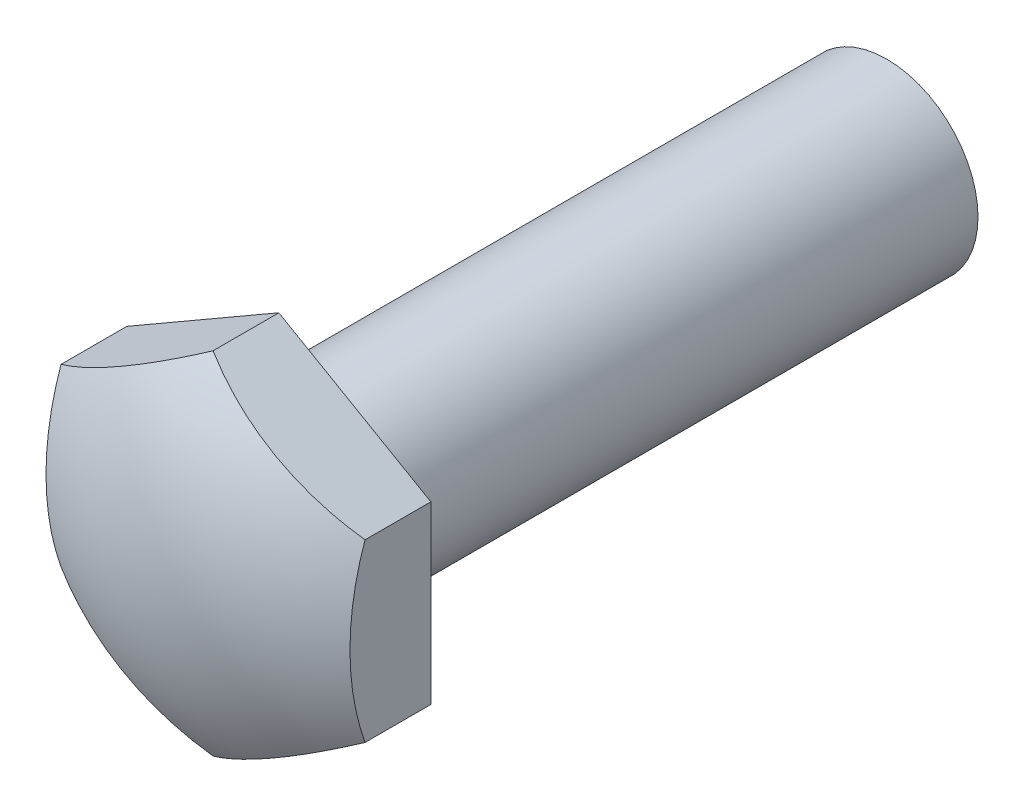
ISO-10303-21;
HEADER;
FILE_DESCRIPTION(('STEP AP214'),'2;1');
FILE_NAME('part.step','',(''),(''),'','','');
FILE_SCHEMA(('AUTOMOTIVE_DESIGN { 1 0 10303 214 1 1 1 1 }'));
ENDSEC;
DATA;
#1=APPLICATION_CONTEXT('core data for automotive mechanical design processes');
#2=APPLICATION_PROTOCOL_DEFINITION('international standard','automotive_design',2000,#1);
#3=PRODUCT_CONTEXT('',#1,'mechanical');
#4=PRODUCT('Part','Part','',(#3));
#5=PRODUCT_RELATED_PRODUCT_CATEGORY('part','',(#4));
#6=PRODUCT_DEFINITION_FORMATION('','',#4);
#7=PRODUCT_DEFINITION_CONTEXT('part definition',#1,'design');
#8=PRODUCT_DEFINITION('design','',#6,#7);
#9=PRODUCT_DEFINITION_SHAPE('','',#8);
#10=(LENGTH_UNIT() NAMED_UNIT(*) SI_UNIT(.MILLI.,.METRE.));
#11=(NAMED_UNIT(*) PLANE_ANGLE_UNIT() SI_UNIT($,.RADIAN.));
#12=(NAMED_UNIT(*) SI_UNIT($,.STERADIAN.) SOLID_ANGLE_UNIT());
#13=UNCERTAINTY_MEASURE_WITH_UNIT(LENGTH_MEASURE(1.E-05),#10,'distance_accuracy_value','');
#14=(GEOMETRIC_REPRESENTATION_CONTEXT(3) GLOBAL_UNCERTAINTY_ASSIGNED_CONTEXT((#13)) GLOBAL_UNIT_ASSIGNED_CONTEXT((#10,
#11,#12)) REPRESENTATION_CONTEXT('',''));
#15=CARTESIAN_POINT('',(0.,0.,0.));
#16=DIRECTION('',(0.,0.,1.));
#17=DIRECTION('',(1.,0.,0.));
#18=AXIS2_PLACEMENT_3D('',#15,#16,#17);
#19=CARTESIAN_POINT('',(0.,0.,-6.));
#20=DIRECTION('',(1.,0.,0.));
#21=DIRECTION('',(0.,0.,-1.));
#22=AXIS2_PLACEMENT_3D('',#19,#20,#21);
#23=SPHERICAL_SURFACE('',#22,10.);
#24=CARTESIAN_POINT('',(-4.99999999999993,0.,-6.));
#25=DIRECTION('',(1.,0.,0.));
#26=DIRECTION('',(0.,1.,0.));
#27=AXIS2_PLACEMENT_3D('',#24,#25,#26);
#28=CIRCLE('',#27,8.66025403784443);
#29=CARTESIAN_POINT('',(-4.99999999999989,-2.8867513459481,2.1649658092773));
#30=VERTEX_POINT('',#29);
#31=CARTESIAN_POINT('',(-4.99999999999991,2.88675134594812,2.16496580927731));
#32=VERTEX_POINT('',#31);
#33=EDGE_CURVE('E18',#30,#32,#28,.F.);
#34=ORIENTED_EDGE('',*,*,#33,.F.);
#35=CARTESIAN_POINT('',(0.,-5.77350269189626,2.16496580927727));
#36=CARTESIAN_POINT('',(-0.201606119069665,-5.65710534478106,2.24730102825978));
#37=CARTESIAN_POINT('',(-0.406275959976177,-5.53893915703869,2.31962723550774));
#38=CARTESIAN_POINT('',(-0.820196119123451,-5.29996224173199,2.44384444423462));
#39=CARTESIAN_POINT('',(-1.02944603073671,-5.17915174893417,2.4957372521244));
#40=CARTESIAN_POINT('',(-1.44515816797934,-4.93914023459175,2.57753268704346));
#41=CARTESIAN_POINT('',(-1.65153627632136,-4.81998777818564,2.60800631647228));
#42=CARTESIAN_POINT('',(-2.06576567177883,-4.58083232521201,2.64905738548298));
#43=CARTESIAN_POINT('',(-2.27361691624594,-4.46082935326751,2.65963539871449));
#44=CARTESIAN_POINT('',(-2.69235852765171,-4.21906877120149,2.66082846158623));
#45=CARTESIAN_POINT('',(-2.90324955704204,-4.09731077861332,2.65115384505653));
#46=CARTESIAN_POINT('',(-3.32358554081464,-3.85462968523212,2.61132475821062));
#47=CARTESIAN_POINT('',(-3.53303041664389,-3.73370662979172,2.58116918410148));
#48=CARTESIAN_POINT('',(-3.95500958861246,-3.49007684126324,2.49941209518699));
#49=CARTESIAN_POINT('',(-4.16745737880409,-3.36742005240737,2.44721410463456));
#50=CARTESIAN_POINT('',(-4.58765562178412,-3.12481848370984,2.32177021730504));
#51=CARTESIAN_POINT('',(-4.79540573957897,-3.0048738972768,2.24852282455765));
#52=CARTESIAN_POINT('',(-4.99999999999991,-2.88675134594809,2.16496580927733));
#53=B_SPLINE_CURVE_WITH_KNOTS('',3,(#35,#36,#37,#38,#39,#40,#41,#42,#43,#44,#45,#46,#47,#48,#49,
#50,#51,#52),.UNSPECIFIED.,.F.,.F.,(4,2,2,2,2,2,2,2,4),(0.,0.740551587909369,1.4810376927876,
2.20094680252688,2.92083515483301,3.65109011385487,4.38138443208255,5.13285373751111,
5.88437646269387),.UNSPECIFIED.);
#54=CARTESIAN_POINT('',(0.,-5.77350269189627,2.16496580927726));
#55=VERTEX_POINT('',#54);
#56=EDGE_CURVE('E108',#55,#30,#53,.T.);
#57=ORIENTED_EDGE('',*,*,#56,.F.);
#58=CARTESIAN_POINT('',(5.00000000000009,-2.88675134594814,2.16496580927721));
#59=CARTESIAN_POINT('',(4.79839388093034,-3.00314869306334,2.24730102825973));
#60=CARTESIAN_POINT('',(4.59372404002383,-3.12131488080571,2.31962723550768));
#61=CARTESIAN_POINT('',(4.17980388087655,-3.3602917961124,2.44384444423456));
#62=CARTESIAN_POINT('',(3.97055396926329,-3.48110228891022,2.49573725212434));
#63=CARTESIAN_POINT('',(3.55484183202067,-3.72111380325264,2.5775326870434));
#64=CARTESIAN_POINT('',(3.34846372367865,-3.84026625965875,2.60800631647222));
#65=CARTESIAN_POINT('',(2.93423432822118,-4.07942171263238,2.64905738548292));
#66=CARTESIAN_POINT('',(2.72638308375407,-4.19942468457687,2.65963539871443));
#67=CARTESIAN_POINT('',(2.3076414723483,-4.44118526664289,2.66082846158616));
#68=CARTESIAN_POINT('',(2.09675044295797,-4.56294325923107,2.65115384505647));
#69=CARTESIAN_POINT('',(1.67641445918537,-4.80562435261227,2.61132475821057));
#70=CARTESIAN_POINT('',(1.46696958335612,-4.92654740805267,2.58116918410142));
#71=CARTESIAN_POINT('',(1.04499041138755,-5.17017719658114,2.49941209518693));
#72=CARTESIAN_POINT('',(0.832542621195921,-5.29283398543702,2.4472141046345));
#73=CARTESIAN_POINT('',(0.412344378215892,-5.53543555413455,2.32177021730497));
#74=CARTESIAN_POINT('',(0.204594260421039,-5.65538014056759,2.24852282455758));
#75=CARTESIAN_POINT('',(0.,-5.77350269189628,2.16496580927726));
#76=B_SPLINE_CURVE_WITH_KNOTS('',3,(#58,#59,#60,#61,#62,#63,#64,#65,#66,#67,#68,#69,#70,#71,#72,
#73,#74,#75),.UNSPECIFIED.,.F.,.F.,(4,2,2,2,2,2,2,2,4),(0.,0.740551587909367,1.48103769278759,
2.20094680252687,2.92083515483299,3.65109011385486,4.38138443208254,5.1328537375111,
5.88437646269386),.UNSPECIFIED.);
#77=CARTESIAN_POINT('',(5.,-2.88675134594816,2.16496580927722));
#78=VERTEX_POINT('',#77);
#79=EDGE_CURVE('E104',#78,#55,#76,.T.);
#80=ORIENTED_EDGE('',*,*,#79,.F.);
#81=CARTESIAN_POINT('',(5.00000000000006,0.,-6.));
#82=DIRECTION('',(1.,0.,0.));
#83=DIRECTION('',(0.,1.,0.));
#84=AXIS2_PLACEMENT_3D('',#81,#82,#83);
#85=CIRCLE('',#84,8.66025403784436);
#86=CARTESIAN_POINT('',(5.00000000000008,2.88675134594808,2.16496580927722));
#87=VERTEX_POINT('',#86);
#88=EDGE_CURVE('E98',#87,#78,#85,.T.);
#89=ORIENTED_EDGE('',*,*,#88,.F.);
#90=CARTESIAN_POINT('',(0.,5.77350269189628,2.16496580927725));
#91=CARTESIAN_POINT('',(0.201606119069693,5.65710534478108,2.24730102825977));
#92=CARTESIAN_POINT('',(0.406275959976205,5.53893915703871,2.31962723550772));
#93=CARTESIAN_POINT('',(0.820196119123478,5.29996224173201,2.4438444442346));
#94=CARTESIAN_POINT('',(1.02944603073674,5.17915174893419,2.49573725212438));
#95=CARTESIAN_POINT('',(1.44515816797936,4.93914023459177,2.57753268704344));
#96=CARTESIAN_POINT('',(1.65153627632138,4.81998777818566,2.60800631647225));
#97=CARTESIAN_POINT('',(2.06576567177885,4.58083232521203,2.64905738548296));
#98=CARTESIAN_POINT('',(2.27361691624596,4.46082935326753,2.65963539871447));
#99=CARTESIAN_POINT('',(2.69235852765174,4.2190687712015,2.66082846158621));
#100=CARTESIAN_POINT('',(2.90324955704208,4.09731077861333,2.65115384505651));
#101=CARTESIAN_POINT('',(3.32358554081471,3.85462968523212,2.6113247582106));
#102=CARTESIAN_POINT('',(3.53303041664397,3.73370662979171,2.58116918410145));
#103=CARTESIAN_POINT('',(3.95500958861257,3.49007684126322,2.49941209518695));
#104=CARTESIAN_POINT('',(4.1674573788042,3.36742005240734,2.44721410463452));
#105=CARTESIAN_POINT('',(4.58765562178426,3.12481848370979,2.32177021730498));
#106=CARTESIAN_POINT('',(4.79540573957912,3.00487389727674,2.24852282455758));
#107=CARTESIAN_POINT('',(5.00000000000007,2.88675134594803,2.16496580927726));
#108=B_SPLINE_CURVE_WITH_KNOTS('',3,(#90,#91,#92,#93,#94,#95,#96,#97,#98,#99,#100,#101,#102,
#103,#104,#105,#106,#107),.UNSPECIFIED.,.F.,.F.,(4,2,2,2,2,2,2,2,4),(0.,0.740551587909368,
1.48103769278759,2.20094680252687,2.920835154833,3.6510901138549,4.38138443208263,
5.13285373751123,5.88437646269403),.UNSPECIFIED.);
#109=CARTESIAN_POINT('',(0.,5.77350269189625,2.16496580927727));
#110=VERTEX_POINT('',#109);
#111=EDGE_CURVE('E78',#110,#87,#108,.T.);
#112=ORIENTED_EDGE('',*,*,#111,.F.);
#113=CARTESIAN_POINT('',(-4.99999999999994,2.88675134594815,2.16496580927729));
#114=CARTESIAN_POINT('',(-4.79839388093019,3.00314869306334,2.24730102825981));
#115=CARTESIAN_POINT('',(-4.59372404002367,3.12131488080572,2.31962723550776));
#116=CARTESIAN_POINT('',(-4.1798038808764,3.36029179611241,2.44384444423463));
#117=CARTESIAN_POINT('',(-3.97055396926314,3.48110228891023,2.49573725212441));
#118=CARTESIAN_POINT('',(-3.55484183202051,3.72111380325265,2.57753268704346));
#119=CARTESIAN_POINT('',(-3.34846372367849,3.84026625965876,2.60800631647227));
#120=CARTESIAN_POINT('',(-2.93423432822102,4.07942171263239,2.64905738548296));
#121=CARTESIAN_POINT('',(-2.72638308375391,4.19942468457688,2.65963539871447));
#122=CARTESIAN_POINT('',(-2.30764147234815,4.4411852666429,2.6608284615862));
#123=CARTESIAN_POINT('',(-2.09675044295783,4.56294325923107,2.6511538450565));
#124=CARTESIAN_POINT('',(-1.67641445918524,4.80562435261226,2.61132475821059));
#125=CARTESIAN_POINT('',(-1.466969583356,4.92654740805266,2.58116918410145));
#126=CARTESIAN_POINT('',(-1.04499041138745,5.17017719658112,2.49941209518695));
#127=CARTESIAN_POINT('',(-0.83254262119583,5.29283398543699,2.44721410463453));
#128=CARTESIAN_POINT('',(-0.41234437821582,5.53543555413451,2.321770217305));
#129=CARTESIAN_POINT('',(-0.204594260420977,5.65538014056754,2.24852282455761));
#130=CARTESIAN_POINT('',(0.,5.77350269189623,2.16496580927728));
#131=B_SPLINE_CURVE_WITH_KNOTS('',3,(#113,#114,#115,#116,#117,#118,#119,#120,#121,#122,#123,
#124,#125,#126,#127,#128,#129,#130),.UNSPECIFIED.,.F.,.F.,(4,2,2,2,2,2,2,2,4),(0.,
0.740551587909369,1.48103769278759,2.20094680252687,2.920835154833,3.65109011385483,
4.38138443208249,5.13285373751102,5.88437646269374),.UNSPECIFIED.);
#132=EDGE_CURVE('E76',#32,#110,#131,.T.);
#133=ORIENTED_EDGE('',*,*,#132,.F.);
#134=EDGE_LOOP('',(#34,#57,#80,#89,#112,#133));
#135=FACE_BOUND('',#134,.T.);
#136=ADVANCED_FACE('F14',(#135),#23,.T.);
#137=CARTESIAN_POINT('',(-4.99999999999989,-2.88675134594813,10.));
#138=DIRECTION('',(-1.,0.,0.));
#139=DIRECTION('',(0.,-1.,0.));
#140=AXIS2_PLACEMENT_3D('',#137,#138,#139);
#141=PLANE('',#140);
#142=DIRECTION('',(0.,0.,1.));
#143=VECTOR('',#142,1.);
#144=CARTESIAN_POINT('',(-4.99999999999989,-2.88675134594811,10.));
#145=LINE('',#144,#143);
#146=CARTESIAN_POINT('',(-4.99999999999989,-2.88675134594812,0.));
#147=VERTEX_POINT('',#146);
#148=EDGE_CURVE('E71',#30,#147,#145,.F.);
#149=ORIENTED_EDGE('',*,*,#148,.F.);
#150=ORIENTED_EDGE('',*,*,#33,.T.);
#151=DIRECTION('',(0.,0.,1.));
#152=VECTOR('',#151,1.);
#153=CARTESIAN_POINT('',(-5.,2.8867513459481,10.));
#154=LINE('',#153,#152);
#155=CARTESIAN_POINT('',(-5.,2.88675134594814,0.));
#156=VERTEX_POINT('',#155);
#157=EDGE_CURVE('E68',#156,#32,#154,.T.);
#158=ORIENTED_EDGE('',*,*,#157,.F.);
#159=DIRECTION('',(0.,1.,0.));
#160=VECTOR('',#159,1.);
#161=CARTESIAN_POINT('',(-4.99999999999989,0.,0.));
#162=LINE('',#161,#160);
#163=EDGE_CURVE('E125',#147,#156,#162,.T.);
#164=ORIENTED_EDGE('',*,*,#163,.F.);
#165=EDGE_LOOP('',(#149,#150,#158,#164));
#166=FACE_BOUND('',#165,.T.);
#167=ADVANCED_FACE('F66',(#166),#141,.T.);
#168=CARTESIAN_POINT('',(-4.99999999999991,2.88675134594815,10.));
#169=DIRECTION('',(-0.5,0.866025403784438,0.));
#170=DIRECTION('',(-0.866025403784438,-0.5,0.));
#171=AXIS2_PLACEMENT_3D('',#168,#169,#170);
#172=PLANE('',#171);
#173=ORIENTED_EDGE('',*,*,#157,.T.);
#174=ORIENTED_EDGE('',*,*,#132,.T.);
#175=DIRECTION('',(0.,0.,1.));
#176=VECTOR('',#175,1.);
#177=CARTESIAN_POINT('',(0.,5.77350269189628,10.));
#178=LINE('',#177,#176);
#179=CARTESIAN_POINT('',(0.,5.77350269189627,0.));
#180=VERTEX_POINT('',#179);
#181=EDGE_CURVE('E81',#180,#110,#178,.T.);
#182=ORIENTED_EDGE('',*,*,#181,.F.);
#183=DIRECTION('',(0.866025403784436,0.5,0.));
#184=VECTOR('',#183,1.);
#185=CARTESIAN_POINT('',(-5.,2.88675134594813,0.));
#186=LINE('',#185,#184);
#187=EDGE_CURVE('E84',#156,#180,#186,.T.);
#188=ORIENTED_EDGE('',*,*,#187,.F.);
#189=EDGE_LOOP('',(#173,#174,#182,#188));
#190=FACE_BOUND('',#189,.T.);
#191=ADVANCED_FACE('F82',(#190),#172,.T.);
#192=CARTESIAN_POINT('',(0.,5.77350269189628,10.));
#193=DIRECTION('',(0.5,0.866025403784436,0.));
#194=DIRECTION('',(-0.866025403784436,0.5,0.));
#195=AXIS2_PLACEMENT_3D('',#192,#193,#194);
#196=PLANE('',#195);
#197=ORIENTED_EDGE('',*,*,#181,.T.);
#198=ORIENTED_EDGE('',*,*,#111,.T.);
#199=DIRECTION('',(0.,0.,1.));
#200=VECTOR('',#199,1.);
#201=CARTESIAN_POINT('',(5.0000000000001,2.88675134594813,10.));
#202=LINE('',#201,#200);
#203=CARTESIAN_POINT('',(5.,2.88675134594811,0.));
#204=VERTEX_POINT('',#203);
#205=EDGE_CURVE('E95',#204,#87,#202,.T.);
#206=ORIENTED_EDGE('',*,*,#205,.F.);
#207=DIRECTION('',(0.866025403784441,-0.5,0.));
#208=VECTOR('',#207,1.);
#209=CARTESIAN_POINT('',(0.,5.77350269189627,0.));
#210=LINE('',#209,#208);
#211=EDGE_CURVE('E131',#180,#204,#210,.T.);
#212=ORIENTED_EDGE('',*,*,#211,.F.);
#213=EDGE_LOOP('',(#197,#198,#206,#212));
#214=FACE_BOUND('',#213,.T.);
#215=ADVANCED_FACE('F176',(#214),#196,.T.);
#216=CARTESIAN_POINT('',(5.0000000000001,2.88675134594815,10.));
#217=DIRECTION('',(1.,0.,0.));
#218=DIRECTION('',(0.,1.,0.));
#219=AXIS2_PLACEMENT_3D('',#216,#217,#218);
#220=PLANE('',#219);
#221=ORIENTED_EDGE('',*,*,#205,.T.);
#222=ORIENTED_EDGE('',*,*,#88,.T.);
#223=DIRECTION('',(0.,0.,1.));
#224=VECTOR('',#223,1.);
#225=CARTESIAN_POINT('',(5.00000000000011,-2.88675134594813,10.));
#226=LINE('',#225,#224);
#227=CARTESIAN_POINT('',(5.00000000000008,-2.88675134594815,0.));
#228=VERTEX_POINT('',#227);
#229=EDGE_CURVE('E101',#228,#78,#226,.T.);
#230=ORIENTED_EDGE('',*,*,#229,.F.);
#231=DIRECTION('',(0.,1.,0.));
#232=VECTOR('',#231,1.);
#233=CARTESIAN_POINT('',(5.,0.,0.));
#234=LINE('',#233,#232);
#235=EDGE_CURVE('E122',#204,#228,#234,.F.);
#236=ORIENTED_EDGE('',*,*,#235,.F.);
#237=EDGE_LOOP('',(#221,#222,#230,#236));
#238=FACE_BOUND('',#237,.T.);
#239=ADVANCED_FACE('F180',(#238),#220,.T.);
#240=CARTESIAN_POINT('',(5.00000000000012,-2.88675134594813,10.));
#241=DIRECTION('',(0.5,-0.866025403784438,0.));
#242=DIRECTION('',(0.866025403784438,0.5,0.));
#243=AXIS2_PLACEMENT_3D('',#240,#241,#242);
#244=PLANE('',#243);
#245=ORIENTED_EDGE('',*,*,#229,.T.);
#246=ORIENTED_EDGE('',*,*,#79,.T.);
#247=DIRECTION('',(0.,0.,1.));
#248=VECTOR('',#247,1.);
#249=CARTESIAN_POINT('',(0.,-5.77350269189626,10.));
#250=LINE('',#249,#248);
#251=CARTESIAN_POINT('',(0.,-5.77350269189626,0.));
#252=VERTEX_POINT('',#251);
#253=EDGE_CURVE('E33',#252,#55,#250,.T.);
#254=ORIENTED_EDGE('',*,*,#253,.F.);
#255=DIRECTION('',(-0.86602540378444,-0.5,0.));
#256=VECTOR('',#255,1.);
#257=CARTESIAN_POINT('',(5.00000000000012,-2.88675134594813,0.));
#258=LINE('',#257,#256);
#259=EDGE_CURVE('E117',#228,#252,#258,.T.);
#260=ORIENTED_EDGE('',*,*,#259,.F.);
#261=EDGE_LOOP('',(#245,#246,#254,#260));
#262=FACE_BOUND('',#261,.T.);
#263=ADVANCED_FACE('F184',(#262),#244,.T.);
#264=CARTESIAN_POINT('',(0.,-5.77350269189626,10.));
#265=DIRECTION('',(-0.5,-0.866025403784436,0.));
#266=DIRECTION('',(0.866025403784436,-0.5,0.));
#267=AXIS2_PLACEMENT_3D('',#264,#265,#266);
#268=PLANE('',#267);
#269=ORIENTED_EDGE('',*,*,#253,.T.);
#270=ORIENTED_EDGE('',*,*,#56,.T.);
#271=ORIENTED_EDGE('',*,*,#148,.T.);
#272=DIRECTION('',(-0.866025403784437,0.5,0.));
#273=VECTOR('',#272,1.);
#274=CARTESIAN_POINT('',(0.,-5.77350269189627,0.));
#275=LINE('',#274,#273);
#276=EDGE_CURVE('E114',#252,#147,#275,.T.);
#277=ORIENTED_EDGE('',*,*,#276,.F.);
#278=EDGE_LOOP('',(#269,#270,#271,#277));
#279=FACE_BOUND('',#278,.T.);
#280=ADVANCED_FACE('F156',(#279),#268,.T.);
#281=CARTESIAN_POINT('',(0.,0.,-19.9999999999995));
#282=DIRECTION('',(0.,0.,-1.));
#283=DIRECTION('',(0.,1.,0.));
#284=AXIS2_PLACEMENT_3D('',#281,#282,#283);
#285=PLANE('',#284);
#286=CARTESIAN_POINT('',(0.,0.,-19.9999999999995));
#287=DIRECTION('',(0.,0.,1.));
#288=DIRECTION('',(0.,-1.,0.));
#289=AXIS2_PLACEMENT_3D('',#286,#287,#288);
#290=CIRCLE('',#289,3.);
#291=CARTESIAN_POINT('',(0.,-3.00000000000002,-19.9999999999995));
#292=VERTEX_POINT('',#291);
#293=EDGE_CURVE('E24',#292,#292,#290,.T.);
#294=ORIENTED_EDGE('',*,*,#293,.F.);
#295=EDGE_LOOP('',(#294));
#296=FACE_BOUND('',#295,.T.);
#297=ADVANCED_FACE('F193',(#296),#285,.T.);
#298=CARTESIAN_POINT('',(2.99999999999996,0.,0.));
#299=DIRECTION('',(0.,0.,-1.));
#300=DIRECTION('',(0.,1.,0.));
#301=AXIS2_PLACEMENT_3D('',#298,#299,#300);
#302=PLANE('',#301);
#303=ORIENTED_EDGE('',*,*,#259,.T.);
#304=ORIENTED_EDGE('',*,*,#276,.T.);
#305=ORIENTED_EDGE('',*,*,#163,.T.);
#306=ORIENTED_EDGE('',*,*,#187,.T.);
#307=ORIENTED_EDGE('',*,*,#211,.T.);
#308=ORIENTED_EDGE('',*,*,#235,.T.);
#309=EDGE_LOOP('',(#303,#304,#305,#306,#307,#308));
#310=FACE_BOUND('',#309,.T.);
#311=CARTESIAN_POINT('',(0.,0.,0.));
#312=DIRECTION('',(0.,0.,1.));
#313=DIRECTION('',(0.,-1.,0.));
#314=AXIS2_PLACEMENT_3D('',#311,#312,#313);
#315=CIRCLE('',#314,3.);
#316=CARTESIAN_POINT('',(0.,-3.,0.));
#317=VERTEX_POINT('',#316);
#318=EDGE_CURVE('E9',#317,#317,#315,.F.);
#319=ORIENTED_EDGE('',*,*,#318,.F.);
#320=EDGE_LOOP('',(#319));
#321=FACE_BOUND('',#320,.T.);
#322=ADVANCED_FACE('F196',(#310,#321),#302,.T.);
#323=CARTESIAN_POINT('',(0.,0.,0.));
#324=DIRECTION('',(0.,0.,1.));
#325=DIRECTION('',(0.,-1.,0.));
#326=AXIS2_PLACEMENT_3D('',#323,#324,#325);
#327=CYLINDRICAL_SURFACE('',#326,3.);
#328=ORIENTED_EDGE('',*,*,#318,.T.);
#329=EDGE_LOOP('',(#328));
#330=FACE_BOUND('',#329,.T.);
#331=ORIENTED_EDGE('',*,*,#293,.T.);
#332=EDGE_LOOP('',(#331));
#333=FACE_BOUND('',#332,.T.);
#334=ADVANCED_FACE('F16',(#330,#333),#327,.T.);
#335=CLOSED_SHELL('',(#136,#167,#191,#215,#239,#263,#280,#297,#322,#334));
#336=MANIFOLD_SOLID_BREP('B1',#335);
#337=ADVANCED_BREP_SHAPE_REPRESENTATION('',(#18,#336),#14);
#338=SHAPE_DEFINITION_REPRESENTATION(#9,#337);
ENDSEC;
END-ISO-10303-21;
